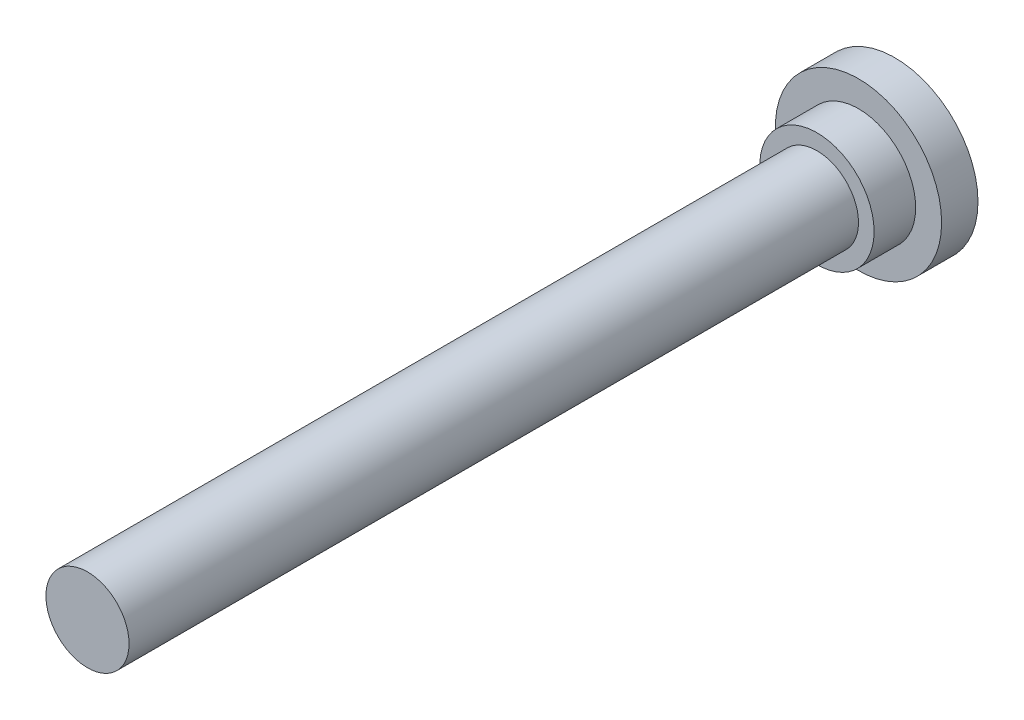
ISO-10303-21;
HEADER;
FILE_DESCRIPTION(('STEP AP214'),'2;1');
FILE_NAME('part.step','',(''),(''),'','','');
FILE_SCHEMA(('AUTOMOTIVE_DESIGN { 1 0 10303 214 1 1 1 1 }'));
ENDSEC;
DATA;
#1=APPLICATION_CONTEXT('core data for automotive mechanical design processes');
#2=APPLICATION_PROTOCOL_DEFINITION('international standard','automotive_design',2000,#1);
#3=PRODUCT_CONTEXT('',#1,'mechanical');
#4=PRODUCT('Part','Part','',(#3));
#5=PRODUCT_RELATED_PRODUCT_CATEGORY('part','',(#4));
#6=PRODUCT_DEFINITION_FORMATION('','',#4);
#7=PRODUCT_DEFINITION_CONTEXT('part definition',#1,'design');
#8=PRODUCT_DEFINITION('design','',#6,#7);
#9=PRODUCT_DEFINITION_SHAPE('','',#8);
#10=(LENGTH_UNIT() NAMED_UNIT(*) SI_UNIT(.MILLI.,.METRE.));
#11=(NAMED_UNIT(*) PLANE_ANGLE_UNIT() SI_UNIT($,.RADIAN.));
#12=(NAMED_UNIT(*) SI_UNIT($,.STERADIAN.) SOLID_ANGLE_UNIT());
#13=UNCERTAINTY_MEASURE_WITH_UNIT(LENGTH_MEASURE(1.E-05),#10,'distance_accuracy_value','');
#14=(GEOMETRIC_REPRESENTATION_CONTEXT(3) GLOBAL_UNCERTAINTY_ASSIGNED_CONTEXT((#13)) GLOBAL_UNIT_ASSIGNED_CONTEXT((#10,
#11,#12)) REPRESENTATION_CONTEXT('',''));
#15=CARTESIAN_POINT('',(0.,0.,0.));
#16=DIRECTION('',(0.,0.,1.));
#17=DIRECTION('',(1.,0.,0.));
#18=AXIS2_PLACEMENT_3D('',#15,#16,#17);
#19=CARTESIAN_POINT('',(0.,0.,155.4));
#20=DIRECTION('',(0.,0.,1.));
#21=DIRECTION('',(1.,0.,0.));
#22=AXIS2_PLACEMENT_3D('',#19,#20,#21);
#23=PLANE('',#22);
#24=CARTESIAN_POINT('',(0.,0.,155.4));
#25=DIRECTION('',(0.,0.,1.));
#26=DIRECTION('',(1.,0.,0.));
#27=AXIS2_PLACEMENT_3D('',#24,#25,#26);
#28=CIRCLE('',#27,8.);
#29=CARTESIAN_POINT('',(8.,0.,155.4));
#30=VERTEX_POINT('',#29);
#31=EDGE_CURVE('E8',#30,#30,#28,.T.);
#32=ORIENTED_EDGE('',*,*,#31,.T.);
#33=EDGE_LOOP('',(#32));
#34=FACE_BOUND('',#33,.T.);
#35=ADVANCED_FACE('F12',(#34),#23,.T.);
#36=CARTESIAN_POINT('',(0.,0.,30.));
#37=DIRECTION('',(0.,0.,1.));
#38=DIRECTION('',(1.,0.,0.));
#39=AXIS2_PLACEMENT_3D('',#36,#37,#38);
#40=CYLINDRICAL_SURFACE('',#39,8.);
#41=CARTESIAN_POINT('',(0.,0.,15.));
#42=DIRECTION('',(0.,0.,1.));
#43=DIRECTION('',(1.,0.,0.));
#44=AXIS2_PLACEMENT_3D('',#41,#42,#43);
#45=CIRCLE('',#44,8.);
#46=CARTESIAN_POINT('',(8.,0.,15.));
#47=VERTEX_POINT('',#46);
#48=EDGE_CURVE('E18',#47,#47,#45,.T.);
#49=ORIENTED_EDGE('',*,*,#48,.T.);
#50=EDGE_LOOP('',(#49));
#51=FACE_BOUND('',#50,.T.);
#52=ORIENTED_EDGE('',*,*,#31,.F.);
#53=EDGE_LOOP('',(#52));
#54=FACE_BOUND('',#53,.T.);
#55=ADVANCED_FACE('F52',(#51,#54),#40,.T.);
#56=CARTESIAN_POINT('',(-8.,0.,15.));
#57=DIRECTION('',(0.,0.,1.));
#58=DIRECTION('',(1.,0.,0.));
#59=AXIS2_PLACEMENT_3D('',#56,#57,#58);
#60=PLANE('',#59);
#61=CARTESIAN_POINT('',(0.,0.,15.));
#62=DIRECTION('',(0.,0.,1.));
#63=DIRECTION('',(1.,0.,0.));
#64=AXIS2_PLACEMENT_3D('',#61,#62,#63);
#65=CIRCLE('',#64,11.);
#66=CARTESIAN_POINT('',(11.,0.,15.));
#67=VERTEX_POINT('',#66);
#68=EDGE_CURVE('E22',#67,#67,#65,.T.);
#69=ORIENTED_EDGE('',*,*,#68,.T.);
#70=EDGE_LOOP('',(#69));
#71=FACE_BOUND('',#70,.T.);
#72=ORIENTED_EDGE('',*,*,#48,.F.);
#73=EDGE_LOOP('',(#72));
#74=FACE_BOUND('',#73,.T.);
#75=ADVANCED_FACE('F57',(#71,#74),#60,.T.);
#76=CARTESIAN_POINT('',(0.,0.,30.));
#77=DIRECTION('',(0.,0.,1.));
#78=DIRECTION('',(1.,0.,0.));
#79=AXIS2_PLACEMENT_3D('',#76,#77,#78);
#80=CYLINDRICAL_SURFACE('',#79,11.);
#81=CARTESIAN_POINT('',(0.,0.,7.));
#82=DIRECTION('',(0.,0.,1.));
#83=DIRECTION('',(1.,0.,0.));
#84=AXIS2_PLACEMENT_3D('',#81,#82,#83);
#85=CIRCLE('',#84,11.);
#86=CARTESIAN_POINT('',(11.,0.,7.));
#87=VERTEX_POINT('',#86);
#88=EDGE_CURVE('E26',#87,#87,#85,.T.);
#89=ORIENTED_EDGE('',*,*,#88,.T.);
#90=EDGE_LOOP('',(#89));
#91=FACE_BOUND('',#90,.T.);
#92=ORIENTED_EDGE('',*,*,#68,.F.);
#93=EDGE_LOOP('',(#92));
#94=FACE_BOUND('',#93,.T.);
#95=ADVANCED_FACE('F62',(#91,#94),#80,.T.);
#96=CARTESIAN_POINT('',(-11.,0.,7.));
#97=DIRECTION('',(0.,0.,1.));
#98=DIRECTION('',(1.,0.,0.));
#99=AXIS2_PLACEMENT_3D('',#96,#97,#98);
#100=PLANE('',#99);
#101=CARTESIAN_POINT('',(0.,0.,7.));
#102=DIRECTION('',(0.,0.,1.));
#103=DIRECTION('',(1.,0.,0.));
#104=AXIS2_PLACEMENT_3D('',#101,#102,#103);
#105=CIRCLE('',#104,16.);
#106=CARTESIAN_POINT('',(16.,0.,7.));
#107=VERTEX_POINT('',#106);
#108=EDGE_CURVE('E31',#107,#107,#105,.T.);
#109=ORIENTED_EDGE('',*,*,#108,.T.);
#110=EDGE_LOOP('',(#109));
#111=FACE_BOUND('',#110,.T.);
#112=ORIENTED_EDGE('',*,*,#88,.F.);
#113=EDGE_LOOP('',(#112));
#114=FACE_BOUND('',#113,.T.);
#115=ADVANCED_FACE('F49',(#111,#114),#100,.T.);
#116=CARTESIAN_POINT('',(0.,0.,30.));
#117=DIRECTION('',(0.,0.,1.));
#118=DIRECTION('',(1.,0.,0.));
#119=AXIS2_PLACEMENT_3D('',#116,#117,#118);
#120=CYLINDRICAL_SURFACE('',#119,16.);
#121=CARTESIAN_POINT('',(0.,0.,0.));
#122=DIRECTION('',(0.,0.,1.));
#123=DIRECTION('',(1.,0.,0.));
#124=AXIS2_PLACEMENT_3D('',#121,#122,#123);
#125=CIRCLE('',#124,16.);
#126=CARTESIAN_POINT('',(16.,0.,0.));
#127=VERTEX_POINT('',#126);
#128=EDGE_CURVE('E34',#127,#127,#125,.T.);
#129=ORIENTED_EDGE('',*,*,#128,.T.);
#130=EDGE_LOOP('',(#129));
#131=FACE_BOUND('',#130,.T.);
#132=ORIENTED_EDGE('',*,*,#108,.F.);
#133=EDGE_LOOP('',(#132));
#134=FACE_BOUND('',#133,.T.);
#135=ADVANCED_FACE('F38',(#131,#134),#120,.T.);
#136=CARTESIAN_POINT('',(-16.,0.,0.));
#137=DIRECTION('',(0.,0.,-1.));
#138=DIRECTION('',(-1.,0.,0.));
#139=AXIS2_PLACEMENT_3D('',#136,#137,#138);
#140=PLANE('',#139);
#141=ORIENTED_EDGE('',*,*,#128,.F.);
#142=EDGE_LOOP('',(#141));
#143=FACE_BOUND('',#142,.T.);
#144=ADVANCED_FACE('F41',(#143),#140,.T.);
#145=CLOSED_SHELL('',(#35,#55,#75,#95,#115,#135,#144));
#146=MANIFOLD_SOLID_BREP('B1',#145);
#147=ADVANCED_BREP_SHAPE_REPRESENTATION('',(#18,#146),#14);
#148=SHAPE_DEFINITION_REPRESENTATION(#9,#147);
ENDSEC;
END-ISO-10303-21;
